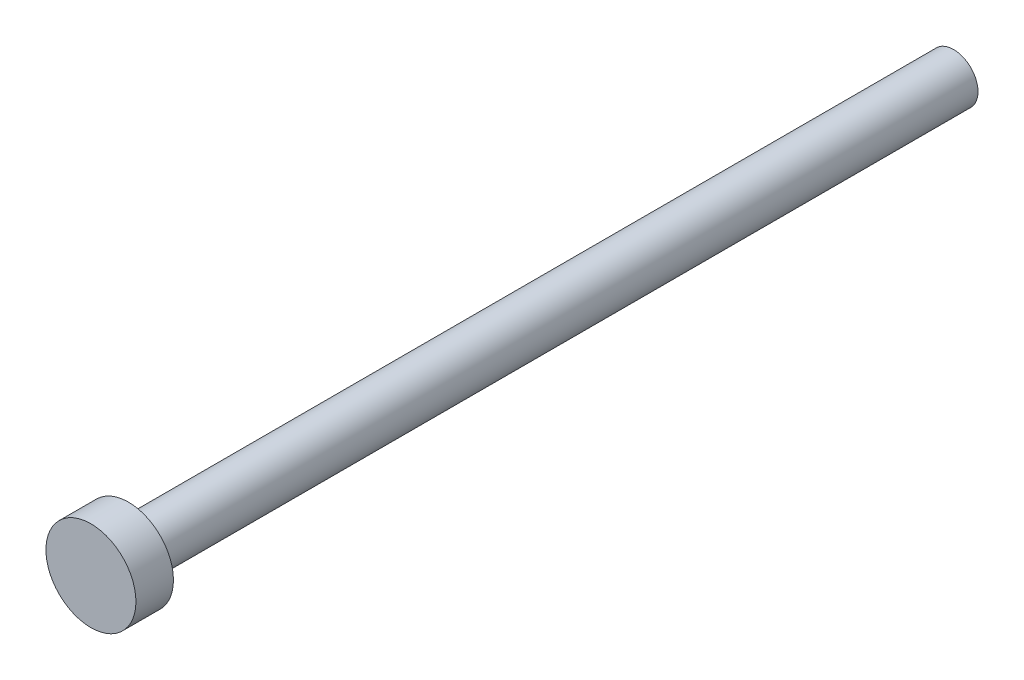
from build123d import *

# Parameters (mm, degrees)
ESQUISSE1_R      = 6
EXTRUSION1_DEPTH = 5
ESQUISSE3_R      = 3.25
EXTRUSION2_DEPTH = 110


with BuildPart() as part:
    # Esquisse1 → Extrusion1 (new body)
    with BuildSketch(Plane.XY):
        Circle(ESQUISSE1_R)
    extrude(amount=EXTRUSION1_DEPTH)

    # Esquisse3 → Extrusion2 (add)
    with BuildSketch(Plane(origin=(0, 0, 0), x_dir=(-1, 0, 0), z_dir=(0, 0, -1))):
        with Locations(Location((0, 0, 0), (0, 0, 180))):
            Circle(ESQUISSE3_R)
    extrude(amount=EXTRUSION2_DEPTH)


solid = part.part
